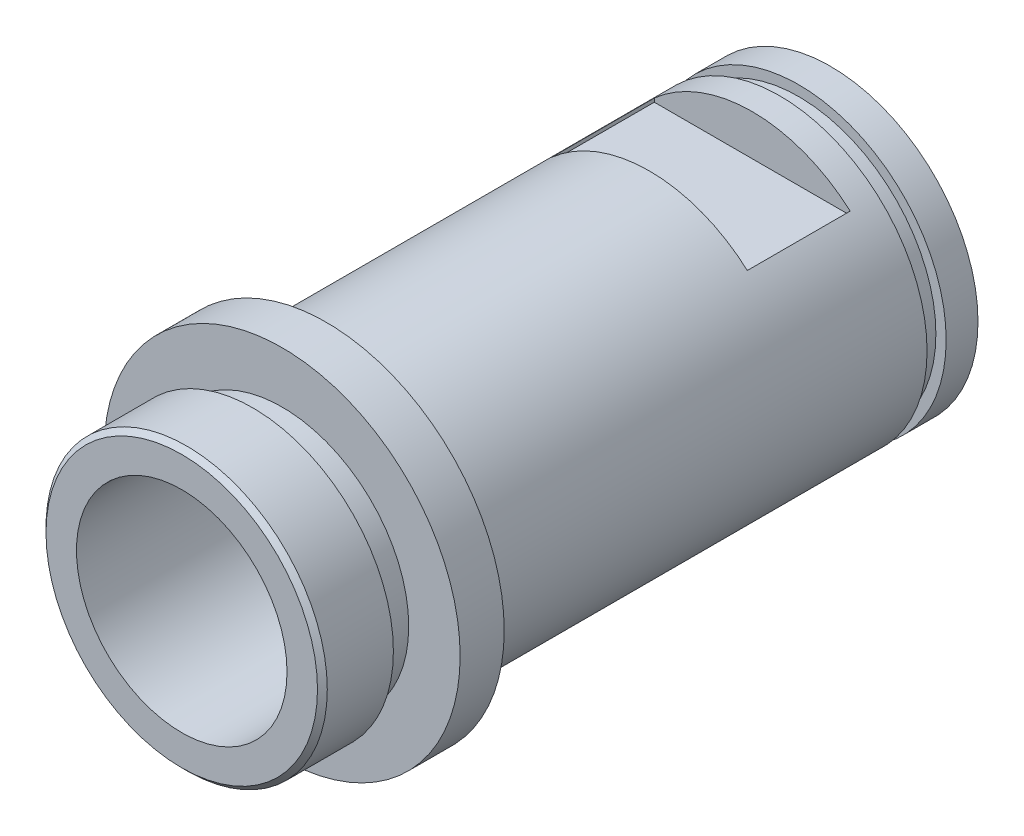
ISO-10303-21;
HEADER;
FILE_DESCRIPTION(('STEP AP214'),'2;1');
FILE_NAME('part.step','',(''),(''),'','','');
FILE_SCHEMA(('AUTOMOTIVE_DESIGN { 1 0 10303 214 1 1 1 1 }'));
ENDSEC;
DATA;
#1=APPLICATION_CONTEXT('core data for automotive mechanical design processes');
#2=APPLICATION_PROTOCOL_DEFINITION('international standard','automotive_design',2000,#1);
#3=PRODUCT_CONTEXT('',#1,'mechanical');
#4=PRODUCT('Part','Part','',(#3));
#5=PRODUCT_RELATED_PRODUCT_CATEGORY('part','',(#4));
#6=PRODUCT_DEFINITION_FORMATION('','',#4);
#7=PRODUCT_DEFINITION_CONTEXT('part definition',#1,'design');
#8=PRODUCT_DEFINITION('design','',#6,#7);
#9=PRODUCT_DEFINITION_SHAPE('','',#8);
#10=(LENGTH_UNIT() NAMED_UNIT(*) SI_UNIT(.MILLI.,.METRE.));
#11=(NAMED_UNIT(*) PLANE_ANGLE_UNIT() SI_UNIT($,.RADIAN.));
#12=(NAMED_UNIT(*) SI_UNIT($,.STERADIAN.) SOLID_ANGLE_UNIT());
#13=UNCERTAINTY_MEASURE_WITH_UNIT(LENGTH_MEASURE(1.E-05),#10,'distance_accuracy_value','');
#14=(GEOMETRIC_REPRESENTATION_CONTEXT(3) GLOBAL_UNCERTAINTY_ASSIGNED_CONTEXT((#13)) GLOBAL_UNIT_ASSIGNED_CONTEXT((#10,
#11,#12)) REPRESENTATION_CONTEXT('',''));
#15=CARTESIAN_POINT('',(0.,0.,0.));
#16=DIRECTION('',(0.,0.,1.));
#17=DIRECTION('',(1.,0.,0.));
#18=AXIS2_PLACEMENT_3D('',#15,#16,#17);
#19=CARTESIAN_POINT('',(0.,0.,7.493));
#20=DIRECTION('',(0.,0.,1.));
#21=DIRECTION('',(1.,0.,0.));
#22=AXIS2_PLACEMENT_3D('',#19,#20,#21);
#23=CYLINDRICAL_SURFACE('',#22,7.6454);
#24=CARTESIAN_POINT('',(0.,0.,0.));
#25=DIRECTION('',(0.,0.,1.));
#26=DIRECTION('',(1.,0.,0.));
#27=AXIS2_PLACEMENT_3D('',#24,#25,#26);
#28=CIRCLE('',#27,7.6454);
#29=CARTESIAN_POINT('',(7.6454,0.,0.));
#30=VERTEX_POINT('',#29);
#31=EDGE_CURVE('E180',#30,#30,#28,.T.);
#32=ORIENTED_EDGE('',*,*,#31,.F.);
#33=EDGE_LOOP('',(#32));
#34=FACE_BOUND('',#33,.T.);
#35=CARTESIAN_POINT('',(0.,0.,-23.5204));
#36=DIRECTION('',(0.,0.,1.));
#37=DIRECTION('',(1.,0.,0.));
#38=AXIS2_PLACEMENT_3D('',#35,#36,#37);
#39=CIRCLE('',#38,7.6454);
#40=CARTESIAN_POINT('',(7.6454,0.,-23.5204));
#41=VERTEX_POINT('',#40);
#42=EDGE_CURVE('E183',#41,#41,#39,.T.);
#43=ORIENTED_EDGE('',*,*,#42,.T.);
#44=EDGE_LOOP('',(#43));
#45=FACE_BOUND('',#44,.T.);
#46=DIRECTION('',(0.,0.,1.));
#47=VECTOR('',#46,1.);
#48=CARTESIAN_POINT('',(5.08,5.71364517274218,7.493));
#49=LINE('',#48,#47);
#50=CARTESIAN_POINT('',(5.08,5.71364517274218,-16.764));
#51=VERTEX_POINT('',#50);
#52=CARTESIAN_POINT('',(5.08,5.71364517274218,-22.098));
#53=VERTEX_POINT('',#52);
#54=EDGE_CURVE('E228',#51,#53,#49,.F.);
#55=ORIENTED_EDGE('',*,*,#54,.F.);
#56=CARTESIAN_POINT('',(0.,0.,-16.764));
#57=DIRECTION('',(0.,0.,-1.));
#58=DIRECTION('',(-1.,0.,0.));
#59=AXIS2_PLACEMENT_3D('',#56,#57,#58);
#60=CIRCLE('',#59,7.6454);
#61=CARTESIAN_POINT('',(-5.08,5.71364517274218,-16.764));
#62=VERTEX_POINT('',#61);
#63=EDGE_CURVE('E225',#51,#62,#60,.F.);
#64=ORIENTED_EDGE('',*,*,#63,.T.);
#65=DIRECTION('',(0.,0.,1.));
#66=VECTOR('',#65,1.);
#67=CARTESIAN_POINT('',(-5.08,5.71364517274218,7.493));
#68=LINE('',#67,#66);
#69=CARTESIAN_POINT('',(-5.08,5.71364517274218,-22.098));
#70=VERTEX_POINT('',#69);
#71=EDGE_CURVE('E219',#62,#70,#68,.F.);
#72=ORIENTED_EDGE('',*,*,#71,.T.);
#73=CARTESIAN_POINT('',(0.,0.,-22.098));
#74=DIRECTION('',(0.,0.,1.));
#75=DIRECTION('',(1.,0.,0.));
#76=AXIS2_PLACEMENT_3D('',#73,#74,#75);
#77=CIRCLE('',#76,7.6454);
#78=EDGE_CURVE('E222',#70,#53,#77,.F.);
#79=ORIENTED_EDGE('',*,*,#78,.T.);
#80=EDGE_LOOP('',(#55,#64,#72,#79));
#81=FACE_BOUND('',#80,.T.);
#82=CARTESIAN_POINT('',(0.,0.,-16.764));
#83=DIRECTION('',(0.,0.,-1.));
#84=DIRECTION('',(-1.,0.,0.));
#85=AXIS2_PLACEMENT_3D('',#82,#83,#84);
#86=CIRCLE('',#85,7.6454);
#87=CARTESIAN_POINT('',(-5.08,-5.71364517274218,-16.764));
#88=VERTEX_POINT('',#87);
#89=CARTESIAN_POINT('',(5.08,-5.71364517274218,-16.764));
#90=VERTEX_POINT('',#89);
#91=EDGE_CURVE('E234',#88,#90,#86,.F.);
#92=ORIENTED_EDGE('',*,*,#91,.T.);
#93=DIRECTION('',(0.,0.,1.));
#94=VECTOR('',#93,1.);
#95=CARTESIAN_POINT('',(5.08,-5.71364517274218,7.493));
#96=LINE('',#95,#94);
#97=CARTESIAN_POINT('',(5.08,-5.71364517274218,-22.098));
#98=VERTEX_POINT('',#97);
#99=EDGE_CURVE('E238',#90,#98,#96,.F.);
#100=ORIENTED_EDGE('',*,*,#99,.T.);
#101=CARTESIAN_POINT('',(0.,0.,-22.098));
#102=DIRECTION('',(0.,0.,1.));
#103=DIRECTION('',(1.,0.,0.));
#104=AXIS2_PLACEMENT_3D('',#101,#102,#103);
#105=CIRCLE('',#104,7.6454);
#106=CARTESIAN_POINT('',(-5.08,-5.71364517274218,-22.098));
#107=VERTEX_POINT('',#106);
#108=EDGE_CURVE('E231',#98,#107,#105,.F.);
#109=ORIENTED_EDGE('',*,*,#108,.T.);
#110=DIRECTION('',(0.,0.,1.));
#111=VECTOR('',#110,1.);
#112=CARTESIAN_POINT('',(-5.08,-5.71364517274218,7.493));
#113=LINE('',#112,#111);
#114=EDGE_CURVE('E124',#88,#107,#113,.F.);
#115=ORIENTED_EDGE('',*,*,#114,.F.);
#116=EDGE_LOOP('',(#92,#100,#109,#115));
#117=FACE_BOUND('',#116,.T.);
#118=ADVANCED_FACE('F45',(#34,#45,#81,#117),#23,.T.);
#119=CARTESIAN_POINT('',(0.,0.,2.286));
#120=DIRECTION('',(0.,0.,1.));
#121=DIRECTION('',(1.,0.,0.));
#122=AXIS2_PLACEMENT_3D('',#119,#120,#121);
#123=PLANE('',#122);
#124=CARTESIAN_POINT('',(0.,0.,2.286));
#125=DIRECTION('',(0.,0.,1.));
#126=DIRECTION('',(1.,0.,0.));
#127=AXIS2_PLACEMENT_3D('',#124,#125,#126);
#128=CIRCLE('',#127,9.2329);
#129=CARTESIAN_POINT('',(9.2329,0.,2.286));
#130=VERTEX_POINT('',#129);
#131=EDGE_CURVE('E174',#130,#130,#128,.T.);
#132=ORIENTED_EDGE('',*,*,#131,.T.);
#133=EDGE_LOOP('',(#132));
#134=FACE_BOUND('',#133,.T.);
#135=CARTESIAN_POINT('',(0.,0.,2.286));
#136=DIRECTION('',(0.,0.,1.));
#137=DIRECTION('',(1.,0.,0.));
#138=AXIS2_PLACEMENT_3D('',#135,#136,#137);
#139=CIRCLE('',#138,6.5659);
#140=CARTESIAN_POINT('',(6.5659,0.,2.286));
#141=VERTEX_POINT('',#140);
#142=EDGE_CURVE('E216',#141,#141,#139,.T.);
#143=ORIENTED_EDGE('',*,*,#142,.F.);
#144=EDGE_LOOP('',(#143));
#145=FACE_BOUND('',#144,.T.);
#146=ADVANCED_FACE('F256',(#134,#145),#123,.T.);
#147=CARTESIAN_POINT('',(0.,0.,7.493));
#148=DIRECTION('',(0.,0.,1.));
#149=DIRECTION('',(1.,0.,0.));
#150=AXIS2_PLACEMENT_3D('',#147,#148,#149);
#151=CYLINDRICAL_SURFACE('',#150,6.5659);
#152=ORIENTED_EDGE('',*,*,#142,.T.);
#153=EDGE_LOOP('',(#152));
#154=FACE_BOUND('',#153,.T.);
#155=CARTESIAN_POINT('',(0.,0.,3.81));
#156=DIRECTION('',(0.,0.,1.));
#157=DIRECTION('',(1.,0.,0.));
#158=AXIS2_PLACEMENT_3D('',#155,#156,#157);
#159=CIRCLE('',#158,6.5659);
#160=CARTESIAN_POINT('',(6.5659,0.,3.81));
#161=VERTEX_POINT('',#160);
#162=EDGE_CURVE('E213',#161,#161,#159,.T.);
#163=ORIENTED_EDGE('',*,*,#162,.F.);
#164=EDGE_LOOP('',(#163));
#165=FACE_BOUND('',#164,.T.);
#166=ADVANCED_FACE('F262',(#154,#165),#151,.T.);
#167=CARTESIAN_POINT('',(0.,0.,3.81));
#168=DIRECTION('',(0.,0.,-1.));
#169=DIRECTION('',(-1.,0.,0.));
#170=AXIS2_PLACEMENT_3D('',#167,#168,#169);
#171=PLANE('',#170);
#172=ORIENTED_EDGE('',*,*,#162,.T.);
#173=EDGE_LOOP('',(#172));
#174=FACE_BOUND('',#173,.T.);
#175=CARTESIAN_POINT('',(0.,0.,3.81));
#176=DIRECTION('',(0.,0.,1.));
#177=DIRECTION('',(1.,0.,0.));
#178=AXIS2_PLACEMENT_3D('',#175,#176,#177);
#179=CIRCLE('',#178,7.29488);
#180=CARTESIAN_POINT('',(7.29488,0.,3.81));
#181=VERTEX_POINT('',#180);
#182=EDGE_CURVE('E210',#181,#181,#179,.T.);
#183=ORIENTED_EDGE('',*,*,#182,.F.);
#184=EDGE_LOOP('',(#183));
#185=FACE_BOUND('',#184,.T.);
#186=ADVANCED_FACE('F299',(#174,#185),#171,.T.);
#187=CARTESIAN_POINT('',(0.,0.,7.493));
#188=DIRECTION('',(0.,0.,1.));
#189=DIRECTION('',(1.,0.,0.));
#190=AXIS2_PLACEMENT_3D('',#187,#188,#189);
#191=CYLINDRICAL_SURFACE('',#190,7.29488);
#192=CARTESIAN_POINT('',(0.,0.,7.23899999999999));
#193=DIRECTION('',(0.,0.,1.));
#194=DIRECTION('',(1.,0.,0.));
#195=AXIS2_PLACEMENT_3D('',#192,#193,#194);
#196=CIRCLE('',#195,7.29488);
#197=CARTESIAN_POINT('',(7.29488,0.,7.23899999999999));
#198=VERTEX_POINT('',#197);
#199=EDGE_CURVE('E11',#198,#198,#196,.F.);
#200=ORIENTED_EDGE('',*,*,#199,.T.);
#201=EDGE_LOOP('',(#200));
#202=FACE_BOUND('',#201,.T.);
#203=ORIENTED_EDGE('',*,*,#182,.T.);
#204=EDGE_LOOP('',(#203));
#205=FACE_BOUND('',#204,.T.);
#206=ADVANCED_FACE('F296',(#202,#205),#191,.T.);
#207=CARTESIAN_POINT('',(0.,0.,7.493));
#208=DIRECTION('',(0.,0.,1.));
#209=DIRECTION('',(1.,0.,0.));
#210=AXIS2_PLACEMENT_3D('',#207,#208,#209);
#211=PLANE('',#210);
#212=CARTESIAN_POINT('',(0.,0.,7.493));
#213=DIRECTION('',(0.,0.,1.));
#214=DIRECTION('',(1.,0.,0.));
#215=AXIS2_PLACEMENT_3D('',#212,#213,#214);
#216=CIRCLE('',#215,7.04087999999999);
#217=CARTESIAN_POINT('',(7.04087999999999,0.,7.493));
#218=VERTEX_POINT('',#217);
#219=EDGE_CURVE('E53',#218,#218,#216,.T.);
#220=ORIENTED_EDGE('',*,*,#219,.T.);
#221=EDGE_LOOP('',(#220));
#222=FACE_BOUND('',#221,.T.);
#223=CARTESIAN_POINT('',(0.,0.,7.493));
#224=DIRECTION('',(0.,0.,1.));
#225=DIRECTION('',(1.,0.,0.));
#226=AXIS2_PLACEMENT_3D('',#223,#224,#225);
#227=CIRCLE('',#226,5.461);
#228=CARTESIAN_POINT('',(5.461,0.,7.493));
#229=VERTEX_POINT('',#228);
#230=EDGE_CURVE('E207',#229,#229,#227,.T.);
#231=ORIENTED_EDGE('',*,*,#230,.F.);
#232=EDGE_LOOP('',(#231));
#233=FACE_BOUND('',#232,.T.);
#234=ADVANCED_FACE('F244',(#222,#233),#211,.T.);
#235=CARTESIAN_POINT('',(0.,0.,7.493));
#236=DIRECTION('',(0.,0.,1.));
#237=DIRECTION('',(1.,0.,0.));
#238=AXIS2_PLACEMENT_3D('',#235,#236,#237);
#239=CYLINDRICAL_SURFACE('',#238,5.461);
#240=ORIENTED_EDGE('',*,*,#230,.T.);
#241=EDGE_LOOP('',(#240));
#242=FACE_BOUND('',#241,.T.);
#243=CARTESIAN_POINT('',(0.,0.,-26.162));
#244=DIRECTION('',(0.,0.,1.));
#245=DIRECTION('',(1.,0.,0.));
#246=AXIS2_PLACEMENT_3D('',#243,#244,#245);
#247=CIRCLE('',#246,5.461);
#248=CARTESIAN_POINT('',(5.461,0.,-26.162));
#249=VERTEX_POINT('',#248);
#250=EDGE_CURVE('E203',#249,#249,#247,.T.);
#251=ORIENTED_EDGE('',*,*,#250,.F.);
#252=EDGE_LOOP('',(#251));
#253=FACE_BOUND('',#252,.T.);
#254=ADVANCED_FACE('F289',(#242,#253),#239,.F.);
#255=CARTESIAN_POINT('',(0.,0.,-26.162));
#256=DIRECTION('',(0.,0.,-1.));
#257=DIRECTION('',(-1.,0.,0.));
#258=AXIS2_PLACEMENT_3D('',#255,#256,#257);
#259=PLANE('',#258);
#260=ORIENTED_EDGE('',*,*,#250,.T.);
#261=EDGE_LOOP('',(#260));
#262=FACE_BOUND('',#261,.T.);
#263=CARTESIAN_POINT('',(0.,0.,-26.162));
#264=DIRECTION('',(0.,0.,1.));
#265=DIRECTION('',(1.,0.,0.));
#266=AXIS2_PLACEMENT_3D('',#263,#264,#265);
#267=CIRCLE('',#266,7.6454);
#268=CARTESIAN_POINT('',(7.6454,0.,-26.162));
#269=VERTEX_POINT('',#268);
#270=EDGE_CURVE('E199',#269,#269,#267,.T.);
#271=ORIENTED_EDGE('',*,*,#270,.F.);
#272=EDGE_LOOP('',(#271));
#273=FACE_BOUND('',#272,.T.);
#274=ADVANCED_FACE('F285',(#262,#273),#259,.T.);
#275=CARTESIAN_POINT('',(0.,0.,7.493));
#276=DIRECTION('',(0.,0.,1.));
#277=DIRECTION('',(1.,0.,0.));
#278=AXIS2_PLACEMENT_3D('',#275,#276,#277);
#279=CYLINDRICAL_SURFACE('',#278,7.6454);
#280=ORIENTED_EDGE('',*,*,#270,.T.);
#281=EDGE_LOOP('',(#280));
#282=FACE_BOUND('',#281,.T.);
#283=CARTESIAN_POINT('',(0.,0.,-24.511));
#284=DIRECTION('',(0.,0.,1.));
#285=DIRECTION('',(1.,0.,0.));
#286=AXIS2_PLACEMENT_3D('',#283,#284,#285);
#287=CIRCLE('',#286,7.6454);
#288=CARTESIAN_POINT('',(7.6454,0.,-24.511));
#289=VERTEX_POINT('',#288);
#290=EDGE_CURVE('E195',#289,#289,#287,.T.);
#291=ORIENTED_EDGE('',*,*,#290,.F.);
#292=EDGE_LOOP('',(#291));
#293=FACE_BOUND('',#292,.T.);
#294=ADVANCED_FACE('F281',(#282,#293),#279,.T.);
#295=CARTESIAN_POINT('',(0.,0.,-24.511));
#296=DIRECTION('',(0.,0.,1.));
#297=DIRECTION('',(1.,0.,0.));
#298=AXIS2_PLACEMENT_3D('',#295,#296,#297);
#299=PLANE('',#298);
#300=ORIENTED_EDGE('',*,*,#290,.T.);
#301=EDGE_LOOP('',(#300));
#302=FACE_BOUND('',#301,.T.);
#303=CARTESIAN_POINT('',(0.,0.,-24.511));
#304=DIRECTION('',(0.,0.,1.));
#305=DIRECTION('',(1.,0.,0.));
#306=AXIS2_PLACEMENT_3D('',#303,#304,#305);
#307=CIRCLE('',#306,7.112);
#308=CARTESIAN_POINT('',(7.112,0.,-24.511));
#309=VERTEX_POINT('',#308);
#310=EDGE_CURVE('E191',#309,#309,#307,.T.);
#311=ORIENTED_EDGE('',*,*,#310,.F.);
#312=EDGE_LOOP('',(#311));
#313=FACE_BOUND('',#312,.T.);
#314=ADVANCED_FACE('F277',(#302,#313),#299,.T.);
#315=CARTESIAN_POINT('',(0.,0.,7.493));
#316=DIRECTION('',(0.,0.,1.));
#317=DIRECTION('',(1.,0.,0.));
#318=AXIS2_PLACEMENT_3D('',#315,#316,#317);
#319=CYLINDRICAL_SURFACE('',#318,7.112);
#320=ORIENTED_EDGE('',*,*,#310,.T.);
#321=EDGE_LOOP('',(#320));
#322=FACE_BOUND('',#321,.T.);
#323=CARTESIAN_POINT('',(0.,0.,-23.5204));
#324=DIRECTION('',(0.,0.,1.));
#325=DIRECTION('',(1.,0.,0.));
#326=AXIS2_PLACEMENT_3D('',#323,#324,#325);
#327=CIRCLE('',#326,7.112);
#328=CARTESIAN_POINT('',(7.112,0.,-23.5204));
#329=VERTEX_POINT('',#328);
#330=EDGE_CURVE('E187',#329,#329,#327,.T.);
#331=ORIENTED_EDGE('',*,*,#330,.F.);
#332=EDGE_LOOP('',(#331));
#333=FACE_BOUND('',#332,.T.);
#334=ADVANCED_FACE('F273',(#322,#333),#319,.T.);
#335=CARTESIAN_POINT('',(0.,0.,-23.5204));
#336=DIRECTION('',(0.,0.,-1.));
#337=DIRECTION('',(-1.,0.,0.));
#338=AXIS2_PLACEMENT_3D('',#335,#336,#337);
#339=PLANE('',#338);
#340=ORIENTED_EDGE('',*,*,#330,.T.);
#341=EDGE_LOOP('',(#340));
#342=FACE_BOUND('',#341,.T.);
#343=ORIENTED_EDGE('',*,*,#42,.F.);
#344=EDGE_LOOP('',(#343));
#345=FACE_BOUND('',#344,.T.);
#346=ADVANCED_FACE('F270',(#342,#345),#339,.T.);
#347=CARTESIAN_POINT('',(0.,0.,0.));
#348=DIRECTION('',(0.,0.,-1.));
#349=DIRECTION('',(-1.,0.,0.));
#350=AXIS2_PLACEMENT_3D('',#347,#348,#349);
#351=PLANE('',#350);
#352=ORIENTED_EDGE('',*,*,#31,.T.);
#353=EDGE_LOOP('',(#352));
#354=FACE_BOUND('',#353,.T.);
#355=CARTESIAN_POINT('',(0.,0.,0.));
#356=DIRECTION('',(0.,0.,1.));
#357=DIRECTION('',(1.,0.,0.));
#358=AXIS2_PLACEMENT_3D('',#355,#356,#357);
#359=CIRCLE('',#358,9.2329);
#360=CARTESIAN_POINT('',(9.2329,0.,0.));
#361=VERTEX_POINT('',#360);
#362=EDGE_CURVE('E177',#361,#361,#359,.T.);
#363=ORIENTED_EDGE('',*,*,#362,.F.);
#364=EDGE_LOOP('',(#363));
#365=FACE_BOUND('',#364,.T.);
#366=ADVANCED_FACE('F268',(#354,#365),#351,.T.);
#367=CARTESIAN_POINT('',(0.,0.,7.493));
#368=DIRECTION('',(0.,0.,1.));
#369=DIRECTION('',(1.,0.,0.));
#370=AXIS2_PLACEMENT_3D('',#367,#368,#369);
#371=CYLINDRICAL_SURFACE('',#370,9.2329);
#372=ORIENTED_EDGE('',*,*,#131,.F.);
#373=EDGE_LOOP('',(#372));
#374=FACE_BOUND('',#373,.T.);
#375=ORIENTED_EDGE('',*,*,#362,.T.);
#376=EDGE_LOOP('',(#375));
#377=FACE_BOUND('',#376,.T.);
#378=ADVANCED_FACE('F359',(#374,#377),#371,.T.);
#379=CARTESIAN_POINT('',(5.08,9.46798163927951,-16.764));
#380=DIRECTION('',(0.,0.,-1.));
#381=DIRECTION('',(-1.,0.,0.));
#382=AXIS2_PLACEMENT_3D('',#379,#380,#381);
#383=PLANE('',#382);
#384=DIRECTION('',(0.,-1.,0.));
#385=VECTOR('',#384,1.);
#386=CARTESIAN_POINT('',(5.08,9.46798163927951,-16.764));
#387=LINE('',#386,#385);
#388=CARTESIAN_POINT('',(5.08,5.5245,-16.764));
#389=VERTEX_POINT('',#388);
#390=EDGE_CURVE('E162',#51,#389,#387,.T.);
#391=ORIENTED_EDGE('',*,*,#390,.T.);
#392=DIRECTION('',(-1.,0.,0.));
#393=VECTOR('',#392,1.);
#394=CARTESIAN_POINT('',(5.08,5.5245,-16.764));
#395=LINE('',#394,#393);
#396=CARTESIAN_POINT('',(-5.08,5.5245,-16.764));
#397=VERTEX_POINT('',#396);
#398=EDGE_CURVE('E171',#389,#397,#395,.T.);
#399=ORIENTED_EDGE('',*,*,#398,.T.);
#400=DIRECTION('',(0.,-1.,0.));
#401=VECTOR('',#400,1.);
#402=CARTESIAN_POINT('',(-5.08,9.46798163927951,-16.764));
#403=LINE('',#402,#401);
#404=EDGE_CURVE('E137',#62,#397,#403,.T.);
#405=ORIENTED_EDGE('',*,*,#404,.F.);
#406=ORIENTED_EDGE('',*,*,#63,.F.);
#407=EDGE_LOOP('',(#391,#399,#405,#406));
#408=FACE_BOUND('',#407,.T.);
#409=ADVANCED_FACE('F366',(#408),#383,.T.);
#410=CARTESIAN_POINT('',(5.08,5.5245,-16.764));
#411=DIRECTION('',(0.,1.,0.));
#412=DIRECTION('',(0.,0.,1.));
#413=AXIS2_PLACEMENT_3D('',#410,#411,#412);
#414=PLANE('',#413);
#415=ORIENTED_EDGE('',*,*,#398,.F.);
#416=DIRECTION('',(0.,0.,-1.));
#417=VECTOR('',#416,1.);
#418=CARTESIAN_POINT('',(5.08,5.5245,-16.764));
#419=LINE('',#418,#417);
#420=CARTESIAN_POINT('',(5.08,5.5245,-22.098));
#421=VERTEX_POINT('',#420);
#422=EDGE_CURVE('E164',#389,#421,#419,.T.);
#423=ORIENTED_EDGE('',*,*,#422,.T.);
#424=DIRECTION('',(-1.,0.,0.));
#425=VECTOR('',#424,1.);
#426=CARTESIAN_POINT('',(5.08,5.5245,-22.098));
#427=LINE('',#426,#425);
#428=CARTESIAN_POINT('',(-5.08,5.5245,-22.098));
#429=VERTEX_POINT('',#428);
#430=EDGE_CURVE('E169',#421,#429,#427,.T.);
#431=ORIENTED_EDGE('',*,*,#430,.T.);
#432=DIRECTION('',(0.,0.,-1.));
#433=VECTOR('',#432,1.);
#434=CARTESIAN_POINT('',(-5.08,5.5245,-16.764));
#435=LINE('',#434,#433);
#436=EDGE_CURVE('E159',#397,#429,#435,.T.);
#437=ORIENTED_EDGE('',*,*,#436,.F.);
#438=EDGE_LOOP('',(#415,#423,#431,#437));
#439=FACE_BOUND('',#438,.T.);
#440=ADVANCED_FACE('F374',(#439),#414,.T.);
#441=CARTESIAN_POINT('',(5.08,9.46798163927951,-22.098));
#442=DIRECTION('',(0.,0.,1.));
#443=DIRECTION('',(1.,0.,0.));
#444=AXIS2_PLACEMENT_3D('',#441,#442,#443);
#445=PLANE('',#444);
#446=DIRECTION('',(0.,1.,0.));
#447=VECTOR('',#446,1.);
#448=CARTESIAN_POINT('',(-5.08,9.46798163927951,-22.098));
#449=LINE('',#448,#447);
#450=EDGE_CURVE('E71',#429,#70,#449,.T.);
#451=ORIENTED_EDGE('',*,*,#450,.F.);
#452=ORIENTED_EDGE('',*,*,#430,.F.);
#453=DIRECTION('',(0.,1.,0.));
#454=VECTOR('',#453,1.);
#455=CARTESIAN_POINT('',(5.08,9.46798163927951,-22.098));
#456=LINE('',#455,#454);
#457=EDGE_CURVE('E166',#421,#53,#456,.T.);
#458=ORIENTED_EDGE('',*,*,#457,.T.);
#459=ORIENTED_EDGE('',*,*,#78,.F.);
#460=EDGE_LOOP('',(#451,#452,#458,#459));
#461=FACE_BOUND('',#460,.T.);
#462=ADVANCED_FACE('F382',(#461),#445,.T.);
#463=CARTESIAN_POINT('',(5.08,5.5245,-16.764));
#464=DIRECTION('',(1.,0.,0.));
#465=DIRECTION('',(0.,0.,-1.));
#466=AXIS2_PLACEMENT_3D('',#463,#464,#465);
#467=PLANE('',#466);
#468=ORIENTED_EDGE('',*,*,#54,.T.);
#469=ORIENTED_EDGE('',*,*,#457,.F.);
#470=ORIENTED_EDGE('',*,*,#422,.F.);
#471=ORIENTED_EDGE('',*,*,#390,.F.);
#472=EDGE_LOOP('',(#468,#469,#470,#471));
#473=FACE_BOUND('',#472,.T.);
#474=ADVANCED_FACE('F390',(#473),#467,.F.);
#475=CARTESIAN_POINT('',(-5.08,5.5245,-16.764));
#476=DIRECTION('',(1.,0.,0.));
#477=DIRECTION('',(0.,0.,-1.));
#478=AXIS2_PLACEMENT_3D('',#475,#476,#477);
#479=PLANE('',#478);
#480=ORIENTED_EDGE('',*,*,#404,.T.);
#481=ORIENTED_EDGE('',*,*,#436,.T.);
#482=ORIENTED_EDGE('',*,*,#450,.T.);
#483=ORIENTED_EDGE('',*,*,#71,.F.);
#484=EDGE_LOOP('',(#480,#481,#482,#483));
#485=FACE_BOUND('',#484,.T.);
#486=ADVANCED_FACE('F398',(#485),#479,.T.);
#487=CARTESIAN_POINT('',(5.08,-9.17335370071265,-16.764));
#488=DIRECTION('',(0.,0.,-1.));
#489=DIRECTION('',(-1.,0.,0.));
#490=AXIS2_PLACEMENT_3D('',#487,#488,#489);
#491=PLANE('',#490);
#492=DIRECTION('',(0.,-1.,0.));
#493=VECTOR('',#492,1.);
#494=CARTESIAN_POINT('',(-5.08,-9.17335370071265,-16.764));
#495=LINE('',#494,#493);
#496=CARTESIAN_POINT('',(-5.08,-5.5245,-16.764));
#497=VERTEX_POINT('',#496);
#498=EDGE_CURVE('E63',#497,#88,#495,.T.);
#499=ORIENTED_EDGE('',*,*,#498,.F.);
#500=DIRECTION('',(-1.,0.,0.));
#501=VECTOR('',#500,1.);
#502=CARTESIAN_POINT('',(5.08,-5.5245,-16.764));
#503=LINE('',#502,#501);
#504=CARTESIAN_POINT('',(5.08,-5.5245,-16.764));
#505=VERTEX_POINT('',#504);
#506=EDGE_CURVE('E138',#505,#497,#503,.T.);
#507=ORIENTED_EDGE('',*,*,#506,.F.);
#508=DIRECTION('',(0.,-1.,0.));
#509=VECTOR('',#508,1.);
#510=CARTESIAN_POINT('',(5.08,-9.17335370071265,-16.764));
#511=LINE('',#510,#509);
#512=EDGE_CURVE('E143',#505,#90,#511,.T.);
#513=ORIENTED_EDGE('',*,*,#512,.T.);
#514=ORIENTED_EDGE('',*,*,#91,.F.);
#515=EDGE_LOOP('',(#499,#507,#513,#514));
#516=FACE_BOUND('',#515,.T.);
#517=ADVANCED_FACE('F406',(#516),#491,.T.);
#518=CARTESIAN_POINT('',(5.08,-9.17335370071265,-22.098));
#519=DIRECTION('',(0.,0.,1.));
#520=DIRECTION('',(1.,0.,0.));
#521=AXIS2_PLACEMENT_3D('',#518,#519,#520);
#522=PLANE('',#521);
#523=DIRECTION('',(0.,1.,0.));
#524=VECTOR('',#523,1.);
#525=CARTESIAN_POINT('',(5.08,-9.17335370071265,-22.098));
#526=LINE('',#525,#524);
#527=CARTESIAN_POINT('',(5.08,-5.5245,-22.098));
#528=VERTEX_POINT('',#527);
#529=EDGE_CURVE('E133',#98,#528,#526,.T.);
#530=ORIENTED_EDGE('',*,*,#529,.T.);
#531=DIRECTION('',(-1.,0.,0.));
#532=VECTOR('',#531,1.);
#533=CARTESIAN_POINT('',(5.08,-5.5245,-22.098));
#534=LINE('',#533,#532);
#535=CARTESIAN_POINT('',(-5.08,-5.5245,-22.098));
#536=VERTEX_POINT('',#535);
#537=EDGE_CURVE('E130',#528,#536,#534,.T.);
#538=ORIENTED_EDGE('',*,*,#537,.T.);
#539=DIRECTION('',(0.,1.,0.));
#540=VECTOR('',#539,1.);
#541=CARTESIAN_POINT('',(-5.08,-9.17335370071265,-22.098));
#542=LINE('',#541,#540);
#543=EDGE_CURVE('E118',#107,#536,#542,.T.);
#544=ORIENTED_EDGE('',*,*,#543,.F.);
#545=ORIENTED_EDGE('',*,*,#108,.F.);
#546=EDGE_LOOP('',(#530,#538,#544,#545));
#547=FACE_BOUND('',#546,.T.);
#548=ADVANCED_FACE('F131',(#547),#522,.T.);
#549=CARTESIAN_POINT('',(5.08,-5.5245,-16.764));
#550=DIRECTION('',(0.,-1.,0.));
#551=DIRECTION('',(0.,0.,-1.));
#552=AXIS2_PLACEMENT_3D('',#549,#550,#551);
#553=PLANE('',#552);
#554=ORIENTED_EDGE('',*,*,#537,.F.);
#555=DIRECTION('',(0.,0.,1.));
#556=VECTOR('',#555,1.);
#557=CARTESIAN_POINT('',(5.08,-5.5245,-16.764));
#558=LINE('',#557,#556);
#559=EDGE_CURVE('E153',#528,#505,#558,.T.);
#560=ORIENTED_EDGE('',*,*,#559,.T.);
#561=ORIENTED_EDGE('',*,*,#506,.T.);
#562=DIRECTION('',(0.,0.,1.));
#563=VECTOR('',#562,1.);
#564=CARTESIAN_POINT('',(-5.08,-5.5245,-16.764));
#565=LINE('',#564,#563);
#566=EDGE_CURVE('E122',#536,#497,#565,.T.);
#567=ORIENTED_EDGE('',*,*,#566,.F.);
#568=EDGE_LOOP('',(#554,#560,#561,#567));
#569=FACE_BOUND('',#568,.T.);
#570=ADVANCED_FACE('F140',(#569),#553,.T.);
#571=CARTESIAN_POINT('',(5.08,-5.5245,-16.764));
#572=DIRECTION('',(-1.,0.,0.));
#573=DIRECTION('',(0.,0.,1.));
#574=AXIS2_PLACEMENT_3D('',#571,#572,#573);
#575=PLANE('',#574);
#576=ORIENTED_EDGE('',*,*,#512,.F.);
#577=ORIENTED_EDGE('',*,*,#559,.F.);
#578=ORIENTED_EDGE('',*,*,#529,.F.);
#579=ORIENTED_EDGE('',*,*,#99,.F.);
#580=EDGE_LOOP('',(#576,#577,#578,#579));
#581=FACE_BOUND('',#580,.T.);
#582=ADVANCED_FACE('F252',(#581),#575,.T.);
#583=CARTESIAN_POINT('',(-5.08,-5.5245,-16.764));
#584=DIRECTION('',(-1.,0.,0.));
#585=DIRECTION('',(0.,0.,1.));
#586=AXIS2_PLACEMENT_3D('',#583,#584,#585);
#587=PLANE('',#586);
#588=ORIENTED_EDGE('',*,*,#114,.T.);
#589=ORIENTED_EDGE('',*,*,#543,.T.);
#590=ORIENTED_EDGE('',*,*,#566,.T.);
#591=ORIENTED_EDGE('',*,*,#498,.T.);
#592=EDGE_LOOP('',(#588,#589,#590,#591));
#593=FACE_BOUND('',#592,.T.);
#594=ADVANCED_FACE('F120',(#593),#587,.F.);
#595=CARTESIAN_POINT('',(0.,0.,7.493));
#596=DIRECTION('',(0.,0.,-1.));
#597=DIRECTION('',(-1.,0.,0.));
#598=AXIS2_PLACEMENT_3D('',#595,#596,#597);
#599=CONICAL_SURFACE('',#598,7.04087999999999,0.78539816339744);
#600=ORIENTED_EDGE('',*,*,#199,.F.);
#601=EDGE_LOOP('',(#600));
#602=FACE_BOUND('',#601,.T.);
#603=ORIENTED_EDGE('',*,*,#219,.F.);
#604=EDGE_LOOP('',(#603));
#605=FACE_BOUND('',#604,.T.);
#606=ADVANCED_FACE('F47',(#602,#605),#599,.T.);
#607=CLOSED_SHELL('',(#118,#146,#166,#186,#206,#234,#254,#274,#294,#314,#334,#346,#366,#378,
#409,#440,#462,#474,#486,#517,#548,#570,#582,#594,#606));
#608=MANIFOLD_SOLID_BREP('B2',#607);
#609=ADVANCED_BREP_SHAPE_REPRESENTATION('',(#18,#608),#14);
#610=SHAPE_DEFINITION_REPRESENTATION(#9,#609);
ENDSEC;
END-ISO-10303-21;
